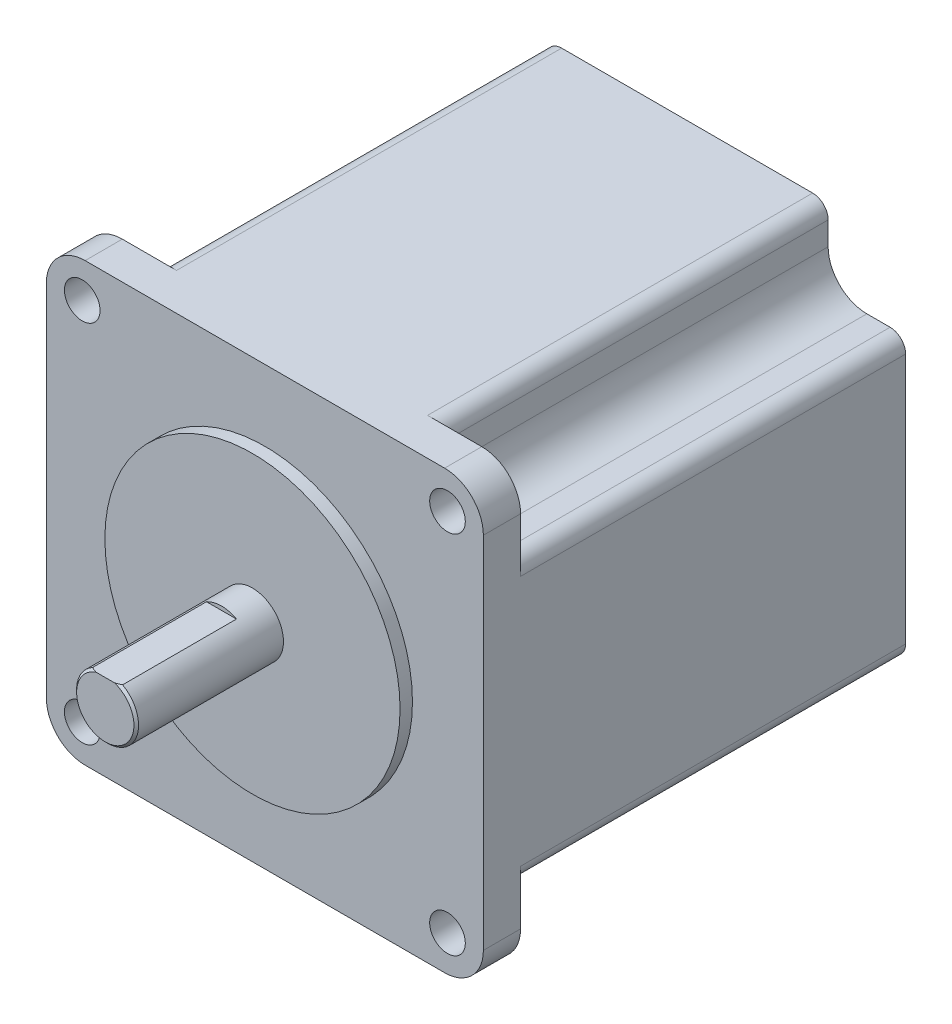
ISO-10303-21;
HEADER;
FILE_DESCRIPTION(('STEP AP214'),'2;1');
FILE_NAME('part.step','',(''),(''),'','','');
FILE_SCHEMA(('AUTOMOTIVE_DESIGN { 1 0 10303 214 1 1 1 1 }'));
ENDSEC;
DATA;
#1=APPLICATION_CONTEXT('core data for automotive mechanical design processes');
#2=APPLICATION_PROTOCOL_DEFINITION('international standard','automotive_design',2000,#1);
#3=PRODUCT_CONTEXT('',#1,'mechanical');
#4=PRODUCT('Part','Part','',(#3));
#5=PRODUCT_RELATED_PRODUCT_CATEGORY('part','',(#4));
#6=PRODUCT_DEFINITION_FORMATION('','',#4);
#7=PRODUCT_DEFINITION_CONTEXT('part definition',#1,'design');
#8=PRODUCT_DEFINITION('design','',#6,#7);
#9=PRODUCT_DEFINITION_SHAPE('','',#8);
#10=(LENGTH_UNIT() NAMED_UNIT(*) SI_UNIT(.MILLI.,.METRE.));
#11=(NAMED_UNIT(*) PLANE_ANGLE_UNIT() SI_UNIT($,.RADIAN.));
#12=(NAMED_UNIT(*) SI_UNIT($,.STERADIAN.) SOLID_ANGLE_UNIT());
#13=UNCERTAINTY_MEASURE_WITH_UNIT(LENGTH_MEASURE(1.E-05),#10,'distance_accuracy_value','');
#14=(GEOMETRIC_REPRESENTATION_CONTEXT(3) GLOBAL_UNCERTAINTY_ASSIGNED_CONTEXT((#13)) GLOBAL_UNIT_ASSIGNED_CONTEXT((#10,
#11,#12)) REPRESENTATION_CONTEXT('',''));
#15=CARTESIAN_POINT('',(0.,0.,0.));
#16=DIRECTION('',(0.,0.,1.));
#17=DIRECTION('',(1.,0.,0.));
#18=AXIS2_PLACEMENT_3D('',#15,#16,#17);
#19=CARTESIAN_POINT('',(23.2,-23.2,-56.1));
#20=DIRECTION('',(0.,0.,1.));
#21=DIRECTION('',(1.,0.,0.));
#22=AXIS2_PLACEMENT_3D('',#19,#20,#21);
#23=CYLINDRICAL_SURFACE('',#22,5.);
#24=CARTESIAN_POINT('',(23.2,-23.2,-6.4));
#25=DIRECTION('',(0.,0.,-1.));
#26=DIRECTION('',(-1.,0.,0.));
#27=AXIS2_PLACEMENT_3D('',#24,#25,#26);
#28=CIRCLE('',#27,5.);
#29=CARTESIAN_POINT('',(28.2,-23.2,-6.4));
#30=VERTEX_POINT('',#29);
#31=CARTESIAN_POINT('',(23.2,-28.2,-6.4));
#32=VERTEX_POINT('',#31);
#33=EDGE_CURVE('E308',#30,#32,#28,.T.);
#34=ORIENTED_EDGE('',*,*,#33,.F.);
#35=DIRECTION('',(0.,0.,1.));
#36=VECTOR('',#35,1.);
#37=CARTESIAN_POINT('',(28.2,-23.2,-56.1));
#38=LINE('',#37,#36);
#39=CARTESIAN_POINT('',(28.2,-23.2,-1.6));
#40=VERTEX_POINT('',#39);
#41=EDGE_CURVE('E473',#30,#40,#38,.T.);
#42=ORIENTED_EDGE('',*,*,#41,.T.);
#43=CARTESIAN_POINT('',(23.2,-23.2,-1.6));
#44=DIRECTION('',(0.,0.,-1.));
#45=DIRECTION('',(1.,0.,0.));
#46=AXIS2_PLACEMENT_3D('',#43,#44,#45);
#47=CIRCLE('',#46,5.);
#48=CARTESIAN_POINT('',(23.2,-28.2,-1.6));
#49=VERTEX_POINT('',#48);
#50=EDGE_CURVE('E463',#40,#49,#47,.T.);
#51=ORIENTED_EDGE('',*,*,#50,.T.);
#52=DIRECTION('',(0.,0.,1.));
#53=VECTOR('',#52,1.);
#54=CARTESIAN_POINT('',(23.2,-28.2,-56.1));
#55=LINE('',#54,#53);
#56=EDGE_CURVE('E509',#32,#49,#55,.T.);
#57=ORIENTED_EDGE('',*,*,#56,.F.);
#58=EDGE_LOOP('',(#34,#42,#51,#57));
#59=FACE_BOUND('',#58,.T.);
#60=ADVANCED_FACE('F33',(#59),#23,.T.);
#61=CARTESIAN_POINT('',(-23.2,-23.2,-56.1));
#62=DIRECTION('',(0.,0.,1.));
#63=DIRECTION('',(1.,0.,0.));
#64=AXIS2_PLACEMENT_3D('',#61,#62,#63);
#65=CYLINDRICAL_SURFACE('',#64,5.);
#66=CARTESIAN_POINT('',(-23.2,-23.2,-6.4));
#67=DIRECTION('',(0.,0.,-1.));
#68=DIRECTION('',(-1.,0.,0.));
#69=AXIS2_PLACEMENT_3D('',#66,#67,#68);
#70=CIRCLE('',#69,5.);
#71=CARTESIAN_POINT('',(-23.2,-28.2,-6.4));
#72=VERTEX_POINT('',#71);
#73=CARTESIAN_POINT('',(-28.2,-23.2,-6.4));
#74=VERTEX_POINT('',#73);
#75=EDGE_CURVE('E353',#72,#74,#70,.T.);
#76=ORIENTED_EDGE('',*,*,#75,.F.);
#77=DIRECTION('',(0.,0.,1.));
#78=VECTOR('',#77,1.);
#79=CARTESIAN_POINT('',(-23.2,-28.2,-56.1));
#80=LINE('',#79,#78);
#81=CARTESIAN_POINT('',(-23.2,-28.2,-1.6));
#82=VERTEX_POINT('',#81);
#83=EDGE_CURVE('E507',#72,#82,#80,.T.);
#84=ORIENTED_EDGE('',*,*,#83,.T.);
#85=CARTESIAN_POINT('',(-23.2,-23.2,-1.6));
#86=DIRECTION('',(0.,0.,-1.));
#87=DIRECTION('',(1.,0.,0.));
#88=AXIS2_PLACEMENT_3D('',#85,#86,#87);
#89=CIRCLE('',#88,5.);
#90=CARTESIAN_POINT('',(-28.2,-23.2,-1.6));
#91=VERTEX_POINT('',#90);
#92=EDGE_CURVE('E479',#82,#91,#89,.T.);
#93=ORIENTED_EDGE('',*,*,#92,.T.);
#94=DIRECTION('',(0.,0.,1.));
#95=VECTOR('',#94,1.);
#96=CARTESIAN_POINT('',(-28.2,-23.2,-56.1));
#97=LINE('',#96,#95);
#98=EDGE_CURVE('E505',#74,#91,#97,.T.);
#99=ORIENTED_EDGE('',*,*,#98,.F.);
#100=EDGE_LOOP('',(#76,#84,#93,#99));
#101=FACE_BOUND('',#100,.T.);
#102=ADVANCED_FACE('F592',(#101),#65,.T.);
#103=CARTESIAN_POINT('',(23.2,23.2,-56.1));
#104=DIRECTION('',(0.,0.,1.));
#105=DIRECTION('',(1.,0.,0.));
#106=AXIS2_PLACEMENT_3D('',#103,#104,#105);
#107=CYLINDRICAL_SURFACE('',#106,5.);
#108=CARTESIAN_POINT('',(23.2,23.2,-6.4));
#109=DIRECTION('',(0.,0.,-1.));
#110=DIRECTION('',(-1.,0.,0.));
#111=AXIS2_PLACEMENT_3D('',#108,#109,#110);
#112=CIRCLE('',#111,5.);
#113=CARTESIAN_POINT('',(23.2,28.2,-6.4));
#114=VERTEX_POINT('',#113);
#115=CARTESIAN_POINT('',(28.2,23.2,-6.4));
#116=VERTEX_POINT('',#115);
#117=EDGE_CURVE('E400',#114,#116,#112,.T.);
#118=ORIENTED_EDGE('',*,*,#117,.F.);
#119=DIRECTION('',(0.,0.,1.));
#120=VECTOR('',#119,1.);
#121=CARTESIAN_POINT('',(23.2,28.2,-56.1));
#122=LINE('',#121,#120);
#123=CARTESIAN_POINT('',(23.2,28.2,-1.6));
#124=VERTEX_POINT('',#123);
#125=EDGE_CURVE('E499',#114,#124,#122,.T.);
#126=ORIENTED_EDGE('',*,*,#125,.T.);
#127=CARTESIAN_POINT('',(23.2,23.2,-1.6));
#128=DIRECTION('',(0.,0.,-1.));
#129=DIRECTION('',(1.,0.,0.));
#130=AXIS2_PLACEMENT_3D('',#127,#128,#129);
#131=CIRCLE('',#130,5.);
#132=CARTESIAN_POINT('',(28.2,23.2,-1.6));
#133=VERTEX_POINT('',#132);
#134=EDGE_CURVE('E491',#124,#133,#131,.T.);
#135=ORIENTED_EDGE('',*,*,#134,.T.);
#136=DIRECTION('',(0.,0.,1.));
#137=VECTOR('',#136,1.);
#138=CARTESIAN_POINT('',(28.2,23.2,-56.1));
#139=LINE('',#138,#137);
#140=EDGE_CURVE('E497',#116,#133,#139,.T.);
#141=ORIENTED_EDGE('',*,*,#140,.F.);
#142=EDGE_LOOP('',(#118,#126,#135,#141));
#143=FACE_BOUND('',#142,.T.);
#144=ADVANCED_FACE('F583',(#143),#107,.T.);
#145=CARTESIAN_POINT('',(0.,0.,0.));
#146=DIRECTION('',(0.,0.,1.));
#147=DIRECTION('',(1.,0.,0.));
#148=AXIS2_PLACEMENT_3D('',#145,#146,#147);
#149=PLANE('',#148);
#150=CARTESIAN_POINT('',(0.,0.,0.));
#151=DIRECTION('',(0.,0.,1.));
#152=DIRECTION('',(1.,0.,0.));
#153=AXIS2_PLACEMENT_3D('',#150,#151,#152);
#154=CIRCLE('',#153,19.05);
#155=CARTESIAN_POINT('',(19.05,0.,0.));
#156=VERTEX_POINT('',#155);
#157=EDGE_CURVE('E528',#156,#156,#154,.T.);
#158=ORIENTED_EDGE('',*,*,#157,.T.);
#159=EDGE_LOOP('',(#158));
#160=FACE_BOUND('',#159,.T.);
#161=CARTESIAN_POINT('',(0.,0.,0.));
#162=DIRECTION('',(0.,0.,1.));
#163=DIRECTION('',(1.,0.,0.));
#164=AXIS2_PLACEMENT_3D('',#161,#162,#163);
#165=CIRCLE('',#164,4.);
#166=CARTESIAN_POINT('',(4.,0.,0.));
#167=VERTEX_POINT('',#166);
#168=EDGE_CURVE('E524',#167,#167,#165,.T.);
#169=ORIENTED_EDGE('',*,*,#168,.F.);
#170=EDGE_LOOP('',(#169));
#171=FACE_BOUND('',#170,.T.);
#172=ADVANCED_FACE('F581',(#160,#171),#149,.T.);
#173=CARTESIAN_POINT('',(0.,0.,-1.6));
#174=DIRECTION('',(0.,0.,1.));
#175=DIRECTION('',(1.,0.,0.));
#176=AXIS2_PLACEMENT_3D('',#173,#174,#175);
#177=CYLINDRICAL_SURFACE('',#176,19.05);
#178=CARTESIAN_POINT('',(0.,0.,-1.6));
#179=DIRECTION('',(0.,0.,1.));
#180=DIRECTION('',(1.,0.,0.));
#181=AXIS2_PLACEMENT_3D('',#178,#179,#180);
#182=CIRCLE('',#181,19.05);
#183=CARTESIAN_POINT('',(19.05,0.,-1.6));
#184=VERTEX_POINT('',#183);
#185=EDGE_CURVE('E511',#184,#184,#182,.F.);
#186=ORIENTED_EDGE('',*,*,#185,.F.);
#187=EDGE_LOOP('',(#186));
#188=FACE_BOUND('',#187,.T.);
#189=ORIENTED_EDGE('',*,*,#157,.F.);
#190=EDGE_LOOP('',(#189));
#191=FACE_BOUND('',#190,.T.);
#192=ADVANCED_FACE('F580',(#188,#191),#177,.T.);
#193=CARTESIAN_POINT('',(0.,0.,19.));
#194=DIRECTION('',(0.,0.,-1.));
#195=DIRECTION('',(-1.,0.,0.));
#196=AXIS2_PLACEMENT_3D('',#193,#194,#195);
#197=CYLINDRICAL_SURFACE('',#196,4.);
#198=DIRECTION('',(0.,0.,1.));
#199=VECTOR('',#198,1.);
#200=CARTESIAN_POINT('',(1.93649167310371,3.5,4.));
#201=LINE('',#200,#199);
#202=CARTESIAN_POINT('',(1.93649167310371,3.5,4.));
#203=VERTEX_POINT('',#202);
#204=CARTESIAN_POINT('',(1.93649167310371,3.5,18.7));
#205=VERTEX_POINT('',#204);
#206=EDGE_CURVE('E522',#203,#205,#201,.T.);
#207=ORIENTED_EDGE('',*,*,#206,.T.);
#208=CARTESIAN_POINT('',(0.,0.,18.7));
#209=DIRECTION('',(0.,0.,1.));
#210=DIRECTION('',(1.,0.,0.));
#211=AXIS2_PLACEMENT_3D('',#208,#209,#210);
#212=CIRCLE('',#211,4.);
#213=CARTESIAN_POINT('',(-1.93649167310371,3.5,18.7));
#214=VERTEX_POINT('',#213);
#215=EDGE_CURVE('E11',#205,#214,#212,.F.);
#216=ORIENTED_EDGE('',*,*,#215,.T.);
#217=DIRECTION('',(0.,0.,1.));
#218=VECTOR('',#217,1.);
#219=CARTESIAN_POINT('',(-1.93649167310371,3.5,4.));
#220=LINE('',#219,#218);
#221=CARTESIAN_POINT('',(-1.93649167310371,3.5,4.));
#222=VERTEX_POINT('',#221);
#223=EDGE_CURVE('E520',#222,#214,#220,.T.);
#224=ORIENTED_EDGE('',*,*,#223,.F.);
#225=CARTESIAN_POINT('',(0.,0.,4.));
#226=DIRECTION('',(0.,0.,1.));
#227=DIRECTION('',(1.,0.,0.));
#228=AXIS2_PLACEMENT_3D('',#225,#226,#227);
#229=CIRCLE('',#228,4.);
#230=EDGE_CURVE('E515',#203,#222,#229,.T.);
#231=ORIENTED_EDGE('',*,*,#230,.F.);
#232=EDGE_LOOP('',(#207,#216,#224,#231));
#233=FACE_BOUND('',#232,.T.);
#234=ORIENTED_EDGE('',*,*,#168,.T.);
#235=EDGE_LOOP('',(#234));
#236=FACE_BOUND('',#235,.T.);
#237=ADVANCED_FACE('F576',(#233,#236),#197,.T.);
#238=CARTESIAN_POINT('',(0.,0.,19.));
#239=DIRECTION('',(0.,0.,1.));
#240=DIRECTION('',(1.,0.,0.));
#241=AXIS2_PLACEMENT_3D('',#238,#239,#240);
#242=PLANE('',#241);
#243=DIRECTION('',(1.,0.,0.));
#244=VECTOR('',#243,1.);
#245=CARTESIAN_POINT('',(-1.93649167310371,3.5,19.));
#246=LINE('',#245,#244);
#247=CARTESIAN_POINT('',(-1.19999999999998,3.5,19.));
#248=VERTEX_POINT('',#247);
#249=CARTESIAN_POINT('',(1.19999999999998,3.5,19.));
#250=VERTEX_POINT('',#249);
#251=EDGE_CURVE('E514',#248,#250,#246,.T.);
#252=ORIENTED_EDGE('',*,*,#251,.F.);
#253=CARTESIAN_POINT('',(0.,0.,19.));
#254=DIRECTION('',(0.,0.,1.));
#255=DIRECTION('',(1.,0.,0.));
#256=AXIS2_PLACEMENT_3D('',#253,#254,#255);
#257=CIRCLE('',#256,3.69999999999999);
#258=EDGE_CURVE('E540',#248,#250,#257,.T.);
#259=ORIENTED_EDGE('',*,*,#258,.T.);
#260=EDGE_LOOP('',(#252,#259));
#261=FACE_BOUND('',#260,.T.);
#262=ADVANCED_FACE('F571',(#261),#242,.T.);
#263=CARTESIAN_POINT('',(-1.93649167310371,3.5,4.));
#264=DIRECTION('',(0.,-1.,0.));
#265=DIRECTION('',(0.,0.,-1.));
#266=AXIS2_PLACEMENT_3D('',#263,#264,#265);
#267=PLANE('',#266);
#268=ORIENTED_EDGE('',*,*,#251,.T.);
#269=CARTESIAN_POINT('',(1.19999999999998,3.5,19.));
#270=CARTESIAN_POINT('',(1.26313496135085,3.5,18.979522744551));
#271=CARTESIAN_POINT('',(1.32583684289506,3.5,18.9577420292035));
#272=CARTESIAN_POINT('',(1.45030237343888,3.5,18.9118563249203));
#273=CARTESIAN_POINT('',(1.51206703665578,3.5,18.8877540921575));
#274=CARTESIAN_POINT('',(1.63472492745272,3.5,18.8374625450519));
#275=CARTESIAN_POINT('',(1.69561828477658,3.5,18.8112735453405));
#276=CARTESIAN_POINT('',(1.8166407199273,3.5,18.7569984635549));
#277=CARTESIAN_POINT('',(1.87676881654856,3.5,18.7289101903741));
#278=CARTESIAN_POINT('',(1.93649167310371,3.5,18.7));
#279=B_SPLINE_CURVE_WITH_KNOTS('',3,(#269,#270,#271,#272,#273,#274,#275,#276,#277,#278),
.UNSPECIFIED.,.F.,.F.,(4,2,2,2,4),(0.,0.199089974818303,0.397946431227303,0.596772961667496,
0.795832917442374),.UNSPECIFIED.);
#280=EDGE_CURVE('E42',#250,#205,#279,.T.);
#281=ORIENTED_EDGE('',*,*,#280,.T.);
#282=ORIENTED_EDGE('',*,*,#206,.F.);
#283=DIRECTION('',(1.,0.,0.));
#284=VECTOR('',#283,1.);
#285=CARTESIAN_POINT('',(-1.93649167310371,3.5,4.));
#286=LINE('',#285,#284);
#287=EDGE_CURVE('E517',#222,#203,#286,.T.);
#288=ORIENTED_EDGE('',*,*,#287,.F.);
#289=ORIENTED_EDGE('',*,*,#223,.T.);
#290=CARTESIAN_POINT('',(-1.93649167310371,3.5,18.7));
#291=CARTESIAN_POINT('',(-1.87676881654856,3.5,18.7289101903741));
#292=CARTESIAN_POINT('',(-1.8166407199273,3.5,18.7569984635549));
#293=CARTESIAN_POINT('',(-1.69561828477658,3.5,18.8112735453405));
#294=CARTESIAN_POINT('',(-1.63472492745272,3.5,18.8374625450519));
#295=CARTESIAN_POINT('',(-1.51206703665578,3.5,18.8877540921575));
#296=CARTESIAN_POINT('',(-1.45030237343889,3.5,18.9118563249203));
#297=CARTESIAN_POINT('',(-1.32583684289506,3.5,18.9577420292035));
#298=CARTESIAN_POINT('',(-1.26313496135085,3.5,18.979522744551));
#299=CARTESIAN_POINT('',(-1.19999999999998,3.5,19.));
#300=B_SPLINE_CURVE_WITH_KNOTS('',3,(#290,#291,#292,#293,#294,#295,#296,#297,#298,#299),
.UNSPECIFIED.,.F.,.F.,(4,2,2,2,4),(0.,0.199059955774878,0.397886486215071,0.596742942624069,
0.795832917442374),.UNSPECIFIED.);
#301=EDGE_CURVE('E557',#214,#248,#300,.T.);
#302=ORIENTED_EDGE('',*,*,#301,.T.);
#303=EDGE_LOOP('',(#268,#281,#282,#288,#289,#302));
#304=FACE_BOUND('',#303,.T.);
#305=ADVANCED_FACE('F565',(#304),#267,.F.);
#306=CARTESIAN_POINT('',(0.,0.,4.));
#307=DIRECTION('',(0.,0.,1.));
#308=DIRECTION('',(1.,0.,0.));
#309=AXIS2_PLACEMENT_3D('',#306,#307,#308);
#310=PLANE('',#309);
#311=ORIENTED_EDGE('',*,*,#230,.T.);
#312=ORIENTED_EDGE('',*,*,#287,.T.);
#313=EDGE_LOOP('',(#311,#312));
#314=FACE_BOUND('',#313,.T.);
#315=ADVANCED_FACE('F570',(#314),#310,.T.);
#316=CARTESIAN_POINT('',(-23.2,-28.2,-56.1));
#317=DIRECTION('',(0.,1.,0.));
#318=DIRECTION('',(-1.,0.,0.));
#319=AXIS2_PLACEMENT_3D('',#316,#317,#318);
#320=PLANE('',#319);
#321=DIRECTION('',(0.,0.,-1.));
#322=VECTOR('',#321,1.);
#323=CARTESIAN_POINT('',(-16.2,-28.2,-6.4));
#324=LINE('',#323,#322);
#325=CARTESIAN_POINT('',(-16.2,-28.2,-6.4));
#326=VERTEX_POINT('',#325);
#327=CARTESIAN_POINT('',(-16.2,-28.2,-56.1));
#328=VERTEX_POINT('',#327);
#329=EDGE_CURVE('E337',#326,#328,#324,.T.);
#330=ORIENTED_EDGE('',*,*,#329,.T.);
#331=DIRECTION('',(-1.,0.,0.));
#332=VECTOR('',#331,1.);
#333=CARTESIAN_POINT('',(-23.2,-28.2,-56.1));
#334=LINE('',#333,#332);
#335=CARTESIAN_POINT('',(16.2,-28.2,-56.1));
#336=VERTEX_POINT('',#335);
#337=EDGE_CURVE('E464',#336,#328,#334,.T.);
#338=ORIENTED_EDGE('',*,*,#337,.F.);
#339=DIRECTION('',(0.,0.,-1.));
#340=VECTOR('',#339,1.);
#341=CARTESIAN_POINT('',(16.2,-28.2,-6.4));
#342=LINE('',#341,#340);
#343=CARTESIAN_POINT('',(16.2,-28.2,-6.4));
#344=VERTEX_POINT('',#343);
#345=EDGE_CURVE('E311',#344,#336,#342,.T.);
#346=ORIENTED_EDGE('',*,*,#345,.F.);
#347=DIRECTION('',(-1.,0.,0.));
#348=VECTOR('',#347,1.);
#349=CARTESIAN_POINT('',(-23.2,-28.2,-6.4));
#350=LINE('',#349,#348);
#351=EDGE_CURVE('E318',#32,#344,#350,.T.);
#352=ORIENTED_EDGE('',*,*,#351,.F.);
#353=ORIENTED_EDGE('',*,*,#56,.T.);
#354=DIRECTION('',(-1.,0.,0.));
#355=VECTOR('',#354,1.);
#356=CARTESIAN_POINT('',(-23.2,-28.2,-1.6));
#357=LINE('',#356,#355);
#358=EDGE_CURVE('E476',#49,#82,#357,.T.);
#359=ORIENTED_EDGE('',*,*,#358,.T.);
#360=ORIENTED_EDGE('',*,*,#83,.F.);
#361=DIRECTION('',(-1.,0.,0.));
#362=VECTOR('',#361,1.);
#363=CARTESIAN_POINT('',(-23.2,-28.2,-6.4));
#364=LINE('',#363,#362);
#365=EDGE_CURVE('E365',#326,#72,#364,.T.);
#366=ORIENTED_EDGE('',*,*,#365,.F.);
#367=EDGE_LOOP('',(#330,#338,#346,#352,#353,#359,#360,#366));
#368=FACE_BOUND('',#367,.T.);
#369=ADVANCED_FACE('F601',(#368),#320,.F.);
#370=CARTESIAN_POINT('',(-28.2,23.2,-56.1));
#371=DIRECTION('',(1.,0.,0.));
#372=DIRECTION('',(0.,1.,0.));
#373=AXIS2_PLACEMENT_3D('',#370,#371,#372);
#374=PLANE('',#373);
#375=DIRECTION('',(0.,0.,-1.));
#376=VECTOR('',#375,1.);
#377=CARTESIAN_POINT('',(-28.2,16.2,-6.4));
#378=LINE('',#377,#376);
#379=CARTESIAN_POINT('',(-28.2,16.2,-6.4));
#380=VERTEX_POINT('',#379);
#381=CARTESIAN_POINT('',(-28.2,16.2,-56.1));
#382=VERTEX_POINT('',#381);
#383=EDGE_CURVE('E445',#380,#382,#378,.T.);
#384=ORIENTED_EDGE('',*,*,#383,.T.);
#385=DIRECTION('',(0.,1.,0.));
#386=VECTOR('',#385,1.);
#387=CARTESIAN_POINT('',(-28.2,23.2,-56.1));
#388=LINE('',#387,#386);
#389=CARTESIAN_POINT('',(-28.2,-16.2,-56.1));
#390=VERTEX_POINT('',#389);
#391=EDGE_CURVE('E466',#390,#382,#388,.T.);
#392=ORIENTED_EDGE('',*,*,#391,.F.);
#393=DIRECTION('',(0.,0.,-1.));
#394=VECTOR('',#393,1.);
#395=CARTESIAN_POINT('',(-28.2,-16.2,-6.4));
#396=LINE('',#395,#394);
#397=CARTESIAN_POINT('',(-28.2,-16.2,-6.4));
#398=VERTEX_POINT('',#397);
#399=EDGE_CURVE('E360',#398,#390,#396,.T.);
#400=ORIENTED_EDGE('',*,*,#399,.F.);
#401=DIRECTION('',(0.,1.,0.));
#402=VECTOR('',#401,1.);
#403=CARTESIAN_POINT('',(-28.2,23.2,-6.4));
#404=LINE('',#403,#402);
#405=EDGE_CURVE('E536',#74,#398,#404,.T.);
#406=ORIENTED_EDGE('',*,*,#405,.F.);
#407=ORIENTED_EDGE('',*,*,#98,.T.);
#408=DIRECTION('',(0.,1.,0.));
#409=VECTOR('',#408,1.);
#410=CARTESIAN_POINT('',(-28.2,23.2,-1.6));
#411=LINE('',#410,#409);
#412=CARTESIAN_POINT('',(-28.2,23.2,-1.6));
#413=VERTEX_POINT('',#412);
#414=EDGE_CURVE('E482',#91,#413,#411,.T.);
#415=ORIENTED_EDGE('',*,*,#414,.T.);
#416=DIRECTION('',(0.,0.,1.));
#417=VECTOR('',#416,1.);
#418=CARTESIAN_POINT('',(-28.2,23.2,-56.1));
#419=LINE('',#418,#417);
#420=CARTESIAN_POINT('',(-28.2,23.2,-6.4));
#421=VERTEX_POINT('',#420);
#422=EDGE_CURVE('E503',#421,#413,#419,.T.);
#423=ORIENTED_EDGE('',*,*,#422,.F.);
#424=DIRECTION('',(0.,-1.,0.));
#425=VECTOR('',#424,1.);
#426=CARTESIAN_POINT('',(-28.2,23.2,-6.4));
#427=LINE('',#426,#425);
#428=EDGE_CURVE('E460',#421,#380,#427,.T.);
#429=ORIENTED_EDGE('',*,*,#428,.T.);
#430=EDGE_LOOP('',(#384,#392,#400,#406,#407,#415,#423,#429));
#431=FACE_BOUND('',#430,.T.);
#432=ADVANCED_FACE('F603',(#431),#374,.F.);
#433=CARTESIAN_POINT('',(-23.2,23.2,-56.1));
#434=DIRECTION('',(0.,0.,1.));
#435=DIRECTION('',(1.,0.,0.));
#436=AXIS2_PLACEMENT_3D('',#433,#434,#435);
#437=CYLINDRICAL_SURFACE('',#436,5.);
#438=DIRECTION('',(0.,0.,1.));
#439=VECTOR('',#438,1.);
#440=CARTESIAN_POINT('',(-23.2,28.2,-56.1));
#441=LINE('',#440,#439);
#442=CARTESIAN_POINT('',(-23.2,28.2,-6.4));
#443=VERTEX_POINT('',#442);
#444=CARTESIAN_POINT('',(-23.2,28.2,-1.6));
#445=VERTEX_POINT('',#444);
#446=EDGE_CURVE('E501',#443,#445,#441,.T.);
#447=ORIENTED_EDGE('',*,*,#446,.F.);
#448=CARTESIAN_POINT('',(-23.2,23.2,-6.4));
#449=DIRECTION('',(0.,0.,1.));
#450=DIRECTION('',(1.,0.,0.));
#451=AXIS2_PLACEMENT_3D('',#448,#449,#450);
#452=CIRCLE('',#451,5.);
#453=EDGE_CURVE('E448',#443,#421,#452,.T.);
#454=ORIENTED_EDGE('',*,*,#453,.T.);
#455=ORIENTED_EDGE('',*,*,#422,.T.);
#456=CARTESIAN_POINT('',(-23.2,23.2,-1.6));
#457=DIRECTION('',(0.,0.,-1.));
#458=DIRECTION('',(1.,0.,0.));
#459=AXIS2_PLACEMENT_3D('',#456,#457,#458);
#460=CIRCLE('',#459,5.);
#461=EDGE_CURVE('E485',#413,#445,#460,.T.);
#462=ORIENTED_EDGE('',*,*,#461,.T.);
#463=EDGE_LOOP('',(#447,#454,#455,#462));
#464=FACE_BOUND('',#463,.T.);
#465=ADVANCED_FACE('F608',(#464),#437,.T.);
#466=CARTESIAN_POINT('',(23.2,28.2,-56.1));
#467=DIRECTION('',(0.,-1.,0.));
#468=DIRECTION('',(1.,0.,0.));
#469=AXIS2_PLACEMENT_3D('',#466,#467,#468);
#470=PLANE('',#469);
#471=DIRECTION('',(0.,0.,-1.));
#472=VECTOR('',#471,1.);
#473=CARTESIAN_POINT('',(16.2,28.2,-6.4));
#474=LINE('',#473,#472);
#475=CARTESIAN_POINT('',(16.2,28.2,-6.4));
#476=VERTEX_POINT('',#475);
#477=CARTESIAN_POINT('',(16.2,28.2,-56.1));
#478=VERTEX_POINT('',#477);
#479=EDGE_CURVE('E384',#476,#478,#474,.T.);
#480=ORIENTED_EDGE('',*,*,#479,.T.);
#481=DIRECTION('',(1.,0.,0.));
#482=VECTOR('',#481,1.);
#483=CARTESIAN_POINT('',(0.,28.2,-56.1));
#484=LINE('',#483,#482);
#485=CARTESIAN_POINT('',(-16.2,28.2,-56.1));
#486=VERTEX_POINT('',#485);
#487=EDGE_CURVE('E469',#486,#478,#484,.T.);
#488=ORIENTED_EDGE('',*,*,#487,.F.);
#489=DIRECTION('',(0.,0.,-1.));
#490=VECTOR('',#489,1.);
#491=CARTESIAN_POINT('',(-16.2,28.2,-6.4));
#492=LINE('',#491,#490);
#493=CARTESIAN_POINT('',(-16.2,28.2,-6.4));
#494=VERTEX_POINT('',#493);
#495=EDGE_CURVE('E431',#494,#486,#492,.T.);
#496=ORIENTED_EDGE('',*,*,#495,.F.);
#497=DIRECTION('',(-1.,0.,0.));
#498=VECTOR('',#497,1.);
#499=CARTESIAN_POINT('',(23.2,28.2,-6.4));
#500=LINE('',#499,#498);
#501=EDGE_CURVE('E531',#494,#443,#500,.T.);
#502=ORIENTED_EDGE('',*,*,#501,.T.);
#503=ORIENTED_EDGE('',*,*,#446,.T.);
#504=DIRECTION('',(1.,0.,0.));
#505=VECTOR('',#504,1.);
#506=CARTESIAN_POINT('',(23.2,28.2,-1.6));
#507=LINE('',#506,#505);
#508=EDGE_CURVE('E488',#445,#124,#507,.T.);
#509=ORIENTED_EDGE('',*,*,#508,.T.);
#510=ORIENTED_EDGE('',*,*,#125,.F.);
#511=DIRECTION('',(1.,0.,0.));
#512=VECTOR('',#511,1.);
#513=CARTESIAN_POINT('',(23.2,28.2,-6.4));
#514=LINE('',#513,#512);
#515=EDGE_CURVE('E412',#476,#114,#514,.T.);
#516=ORIENTED_EDGE('',*,*,#515,.F.);
#517=EDGE_LOOP('',(#480,#488,#496,#502,#503,#509,#510,#516));
#518=FACE_BOUND('',#517,.T.);
#519=ADVANCED_FACE('F612',(#518),#470,.F.);
#520=CARTESIAN_POINT('',(28.2,-23.2,-56.1));
#521=DIRECTION('',(-1.,0.,0.));
#522=DIRECTION('',(0.,0.,1.));
#523=AXIS2_PLACEMENT_3D('',#520,#521,#522);
#524=PLANE('',#523);
#525=DIRECTION('',(0.,0.,-1.));
#526=VECTOR('',#525,1.);
#527=CARTESIAN_POINT('',(28.2,-16.2,-6.4));
#528=LINE('',#527,#526);
#529=CARTESIAN_POINT('',(28.2,-16.2,-6.4));
#530=VERTEX_POINT('',#529);
#531=CARTESIAN_POINT('',(28.2,-16.2,-56.1));
#532=VERTEX_POINT('',#531);
#533=EDGE_CURVE('E313',#530,#532,#528,.T.);
#534=ORIENTED_EDGE('',*,*,#533,.T.);
#535=DIRECTION('',(0.,-1.,0.));
#536=VECTOR('',#535,1.);
#537=CARTESIAN_POINT('',(28.2,-23.2,-56.1));
#538=LINE('',#537,#536);
#539=CARTESIAN_POINT('',(28.2,16.2,-56.1));
#540=VERTEX_POINT('',#539);
#541=EDGE_CURVE('E471',#540,#532,#538,.T.);
#542=ORIENTED_EDGE('',*,*,#541,.F.);
#543=DIRECTION('',(0.,0.,-1.));
#544=VECTOR('',#543,1.);
#545=CARTESIAN_POINT('',(28.2,16.2,-6.4));
#546=LINE('',#545,#544);
#547=CARTESIAN_POINT('',(28.2,16.2,-6.4));
#548=VERTEX_POINT('',#547);
#549=EDGE_CURVE('E407',#548,#540,#546,.T.);
#550=ORIENTED_EDGE('',*,*,#549,.F.);
#551=DIRECTION('',(0.,-1.,0.));
#552=VECTOR('',#551,1.);
#553=CARTESIAN_POINT('',(28.2,-23.2,-6.4));
#554=LINE('',#553,#552);
#555=EDGE_CURVE('E534',#116,#548,#554,.T.);
#556=ORIENTED_EDGE('',*,*,#555,.F.);
#557=ORIENTED_EDGE('',*,*,#140,.T.);
#558=DIRECTION('',(0.,-1.,0.));
#559=VECTOR('',#558,1.);
#560=CARTESIAN_POINT('',(28.2,-23.2,-1.6));
#561=LINE('',#560,#559);
#562=EDGE_CURVE('E467',#133,#40,#561,.T.);
#563=ORIENTED_EDGE('',*,*,#562,.T.);
#564=ORIENTED_EDGE('',*,*,#41,.F.);
#565=DIRECTION('',(0.,-1.,0.));
#566=VECTOR('',#565,1.);
#567=CARTESIAN_POINT('',(28.2,-23.2,-6.4));
#568=LINE('',#567,#566);
#569=EDGE_CURVE('E538',#530,#30,#568,.T.);
#570=ORIENTED_EDGE('',*,*,#569,.F.);
#571=EDGE_LOOP('',(#534,#542,#550,#556,#557,#563,#564,#570));
#572=FACE_BOUND('',#571,.T.);
#573=ADVANCED_FACE('F616',(#572),#524,.F.);
#574=CARTESIAN_POINT('',(23.2,-23.2,-56.1));
#575=DIRECTION('',(0.,0.,1.));
#576=DIRECTION('',(1.,0.,0.));
#577=AXIS2_PLACEMENT_3D('',#574,#575,#576);
#578=PLANE('',#577);
#579=DIRECTION('',(0.,1.,0.));
#580=VECTOR('',#579,1.);
#581=CARTESIAN_POINT('',(18.2,-26.2,-56.1));
#582=LINE('',#581,#580);
#583=CARTESIAN_POINT('',(18.2,-26.2,-56.1));
#584=VERTEX_POINT('',#583);
#585=CARTESIAN_POINT('',(18.2,-23.2,-56.1));
#586=VERTEX_POINT('',#585);
#587=EDGE_CURVE('E284',#584,#586,#582,.T.);
#588=ORIENTED_EDGE('',*,*,#587,.F.);
#589=CARTESIAN_POINT('',(16.2,-26.2,-56.1));
#590=DIRECTION('',(0.,0.,1.));
#591=DIRECTION('',(1.,0.,0.));
#592=AXIS2_PLACEMENT_3D('',#589,#590,#591);
#593=CIRCLE('',#592,1.99999999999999);
#594=EDGE_CURVE('E287',#336,#584,#593,.T.);
#595=ORIENTED_EDGE('',*,*,#594,.F.);
#596=ORIENTED_EDGE('',*,*,#337,.T.);
#597=CARTESIAN_POINT('',(-16.2,-26.2,-56.1));
#598=DIRECTION('',(0.,0.,1.));
#599=DIRECTION('',(-1.,0.,0.));
#600=AXIS2_PLACEMENT_3D('',#597,#598,#599);
#601=CIRCLE('',#600,2.);
#602=CARTESIAN_POINT('',(-18.2,-26.2,-56.1));
#603=VERTEX_POINT('',#602);
#604=EDGE_CURVE('E320',#603,#328,#601,.T.);
#605=ORIENTED_EDGE('',*,*,#604,.F.);
#606=DIRECTION('',(0.,-1.,0.));
#607=VECTOR('',#606,1.);
#608=CARTESIAN_POINT('',(-18.2,-26.2,-56.1));
#609=LINE('',#608,#607);
#610=CARTESIAN_POINT('',(-18.2,-23.2,-56.1));
#611=VERTEX_POINT('',#610);
#612=EDGE_CURVE('E325',#611,#603,#609,.T.);
#613=ORIENTED_EDGE('',*,*,#612,.F.);
#614=CARTESIAN_POINT('',(-23.2,-23.2,-56.1));
#615=DIRECTION('',(0.,0.,-1.));
#616=DIRECTION('',(1.,0.,0.));
#617=AXIS2_PLACEMENT_3D('',#614,#615,#616);
#618=CIRCLE('',#617,5.);
#619=CARTESIAN_POINT('',(-23.2,-18.2,-56.1));
#620=VERTEX_POINT('',#619);
#621=EDGE_CURVE('E346',#620,#611,#618,.T.);
#622=ORIENTED_EDGE('',*,*,#621,.F.);
#623=DIRECTION('',(1.,0.,0.));
#624=VECTOR('',#623,1.);
#625=CARTESIAN_POINT('',(-23.2,-18.2,-56.1));
#626=LINE('',#625,#624);
#627=CARTESIAN_POINT('',(-26.2,-18.2,-56.1));
#628=VERTEX_POINT('',#627);
#629=EDGE_CURVE('E343',#628,#620,#626,.T.);
#630=ORIENTED_EDGE('',*,*,#629,.F.);
#631=CARTESIAN_POINT('',(-26.2,-16.2,-56.1));
#632=DIRECTION('',(0.,0.,1.));
#633=DIRECTION('',(-1.,0.,0.));
#634=AXIS2_PLACEMENT_3D('',#631,#632,#633);
#635=CIRCLE('',#634,2.);
#636=EDGE_CURVE('E340',#390,#628,#635,.T.);
#637=ORIENTED_EDGE('',*,*,#636,.F.);
#638=ORIENTED_EDGE('',*,*,#391,.T.);
#639=CARTESIAN_POINT('',(-26.2,16.2,-56.1));
#640=DIRECTION('',(0.,0.,1.));
#641=DIRECTION('',(1.,0.,0.));
#642=AXIS2_PLACEMENT_3D('',#639,#640,#641);
#643=CIRCLE('',#642,2.);
#644=CARTESIAN_POINT('',(-26.2,18.2,-56.1));
#645=VERTEX_POINT('',#644);
#646=EDGE_CURVE('E419',#645,#382,#643,.T.);
#647=ORIENTED_EDGE('',*,*,#646,.F.);
#648=DIRECTION('',(-1.,0.,0.));
#649=VECTOR('',#648,1.);
#650=CARTESIAN_POINT('',(-23.2,18.2,-56.1));
#651=LINE('',#650,#649);
#652=CARTESIAN_POINT('',(-23.2,18.2,-56.1));
#653=VERTEX_POINT('',#652);
#654=EDGE_CURVE('E440',#653,#645,#651,.T.);
#655=ORIENTED_EDGE('',*,*,#654,.F.);
#656=CARTESIAN_POINT('',(-23.2,23.2,-56.1));
#657=DIRECTION('',(0.,0.,-1.));
#658=DIRECTION('',(-1.,0.,0.));
#659=AXIS2_PLACEMENT_3D('',#656,#657,#658);
#660=CIRCLE('',#659,5.);
#661=CARTESIAN_POINT('',(-18.2,23.2,-56.1));
#662=VERTEX_POINT('',#661);
#663=EDGE_CURVE('E437',#662,#653,#660,.T.);
#664=ORIENTED_EDGE('',*,*,#663,.F.);
#665=DIRECTION('',(0.,-1.,0.));
#666=VECTOR('',#665,1.);
#667=CARTESIAN_POINT('',(-18.2,26.2,-56.1));
#668=LINE('',#667,#666);
#669=CARTESIAN_POINT('',(-18.2,26.2,-56.1));
#670=VERTEX_POINT('',#669);
#671=EDGE_CURVE('E434',#670,#662,#668,.T.);
#672=ORIENTED_EDGE('',*,*,#671,.F.);
#673=CARTESIAN_POINT('',(-16.2,26.2,-56.1));
#674=DIRECTION('',(0.,0.,1.));
#675=DIRECTION('',(1.,0.,0.));
#676=AXIS2_PLACEMENT_3D('',#673,#674,#675);
#677=CIRCLE('',#676,2.);
#678=EDGE_CURVE('E414',#486,#670,#677,.T.);
#679=ORIENTED_EDGE('',*,*,#678,.F.);
#680=ORIENTED_EDGE('',*,*,#487,.T.);
#681=CARTESIAN_POINT('',(16.2,26.2,-56.1));
#682=DIRECTION('',(0.,0.,1.));
#683=DIRECTION('',(-1.,0.,0.));
#684=AXIS2_PLACEMENT_3D('',#681,#682,#683);
#685=CIRCLE('',#684,1.99999999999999);
#686=CARTESIAN_POINT('',(18.2,26.2,-56.1));
#687=VERTEX_POINT('',#686);
#688=EDGE_CURVE('E367',#687,#478,#685,.T.);
#689=ORIENTED_EDGE('',*,*,#688,.F.);
#690=DIRECTION('',(0.,1.,0.));
#691=VECTOR('',#690,1.);
#692=CARTESIAN_POINT('',(18.2,26.2,-56.1));
#693=LINE('',#692,#691);
#694=CARTESIAN_POINT('',(18.2,23.2,-56.1));
#695=VERTEX_POINT('',#694);
#696=EDGE_CURVE('E372',#695,#687,#693,.T.);
#697=ORIENTED_EDGE('',*,*,#696,.F.);
#698=CARTESIAN_POINT('',(23.2,23.2,-56.1));
#699=DIRECTION('',(0.,0.,-1.));
#700=DIRECTION('',(1.,0.,0.));
#701=AXIS2_PLACEMENT_3D('',#698,#699,#700);
#702=CIRCLE('',#701,5.);
#703=CARTESIAN_POINT('',(23.2,18.2,-56.1));
#704=VERTEX_POINT('',#703);
#705=EDGE_CURVE('E393',#704,#695,#702,.T.);
#706=ORIENTED_EDGE('',*,*,#705,.F.);
#707=DIRECTION('',(-1.,0.,0.));
#708=VECTOR('',#707,1.);
#709=CARTESIAN_POINT('',(23.2,18.2,-56.1));
#710=LINE('',#709,#708);
#711=CARTESIAN_POINT('',(26.2,18.2,-56.1));
#712=VERTEX_POINT('',#711);
#713=EDGE_CURVE('E390',#712,#704,#710,.T.);
#714=ORIENTED_EDGE('',*,*,#713,.F.);
#715=CARTESIAN_POINT('',(26.2,16.2,-56.1));
#716=DIRECTION('',(0.,0.,1.));
#717=DIRECTION('',(-1.,0.,0.));
#718=AXIS2_PLACEMENT_3D('',#715,#716,#717);
#719=CIRCLE('',#718,2.);
#720=EDGE_CURVE('E387',#540,#712,#719,.T.);
#721=ORIENTED_EDGE('',*,*,#720,.F.);
#722=ORIENTED_EDGE('',*,*,#541,.T.);
#723=CARTESIAN_POINT('',(26.2,-16.2,-56.1));
#724=DIRECTION('',(0.,0.,1.));
#725=DIRECTION('',(1.,0.,0.));
#726=AXIS2_PLACEMENT_3D('',#723,#724,#725);
#727=CIRCLE('',#726,2.);
#728=CARTESIAN_POINT('',(26.2,-18.2,-56.1));
#729=VERTEX_POINT('',#728);
#730=EDGE_CURVE('E301',#729,#532,#727,.T.);
#731=ORIENTED_EDGE('',*,*,#730,.F.);
#732=DIRECTION('',(1.,0.,0.));
#733=VECTOR('',#732,1.);
#734=CARTESIAN_POINT('',(23.2,-18.2,-56.1));
#735=LINE('',#734,#733);
#736=CARTESIAN_POINT('',(23.2,-18.2,-56.1));
#737=VERTEX_POINT('',#736);
#738=EDGE_CURVE('E298',#737,#729,#735,.T.);
#739=ORIENTED_EDGE('',*,*,#738,.F.);
#740=CARTESIAN_POINT('',(23.2,-23.2,-56.1));
#741=DIRECTION('',(0.,0.,-1.));
#742=DIRECTION('',(-1.,0.,0.));
#743=AXIS2_PLACEMENT_3D('',#740,#741,#742);
#744=CIRCLE('',#743,5.);
#745=EDGE_CURVE('E266',#586,#737,#744,.T.);
#746=ORIENTED_EDGE('',*,*,#745,.F.);
#747=EDGE_LOOP('',(#588,#595,#596,#605,#613,#622,#630,#637,#638,#647,#655,#664,#672,#679,#680,
#689,#697,#706,#714,#721,#722,#731,#739,#746));
#748=FACE_BOUND('',#747,.T.);
#749=ADVANCED_FACE('F623',(#748),#578,.F.);
#750=CARTESIAN_POINT('',(23.2,-23.2,-1.6));
#751=DIRECTION('',(0.,0.,1.));
#752=DIRECTION('',(1.,0.,0.));
#753=AXIS2_PLACEMENT_3D('',#750,#751,#752);
#754=PLANE('',#753);
#755=CARTESIAN_POINT('',(-23.57,-23.57,-1.6));
#756=DIRECTION('',(0.,0.,1.));
#757=DIRECTION('',(1.,0.,0.));
#758=AXIS2_PLACEMENT_3D('',#755,#756,#757);
#759=CIRCLE('',#758,2.3);
#760=CARTESIAN_POINT('',(-21.27,-23.57,-1.6));
#761=VERTEX_POINT('',#760);
#762=EDGE_CURVE('E554',#761,#761,#759,.T.);
#763=ORIENTED_EDGE('',*,*,#762,.F.);
#764=EDGE_LOOP('',(#763));
#765=FACE_BOUND('',#764,.T.);
#766=CARTESIAN_POINT('',(23.57,-23.57,-1.6));
#767=DIRECTION('',(0.,0.,1.));
#768=DIRECTION('',(1.,0.,0.));
#769=AXIS2_PLACEMENT_3D('',#766,#767,#768);
#770=CIRCLE('',#769,2.3);
#771=CARTESIAN_POINT('',(25.87,-23.57,-1.6));
#772=VERTEX_POINT('',#771);
#773=EDGE_CURVE('E550',#772,#772,#770,.T.);
#774=ORIENTED_EDGE('',*,*,#773,.F.);
#775=EDGE_LOOP('',(#774));
#776=FACE_BOUND('',#775,.T.);
#777=CARTESIAN_POINT('',(23.57,23.57,-1.6));
#778=DIRECTION('',(0.,0.,1.));
#779=DIRECTION('',(1.,0.,0.));
#780=AXIS2_PLACEMENT_3D('',#777,#778,#779);
#781=CIRCLE('',#780,2.3);
#782=CARTESIAN_POINT('',(25.87,23.57,-1.6));
#783=VERTEX_POINT('',#782);
#784=EDGE_CURVE('E546',#783,#783,#781,.T.);
#785=ORIENTED_EDGE('',*,*,#784,.F.);
#786=EDGE_LOOP('',(#785));
#787=FACE_BOUND('',#786,.T.);
#788=CARTESIAN_POINT('',(-23.57,23.57,-1.6));
#789=DIRECTION('',(0.,0.,1.));
#790=DIRECTION('',(1.,0.,0.));
#791=AXIS2_PLACEMENT_3D('',#788,#789,#790);
#792=CIRCLE('',#791,2.3);
#793=CARTESIAN_POINT('',(-21.27,23.57,-1.6));
#794=VERTEX_POINT('',#793);
#795=EDGE_CURVE('E290',#794,#794,#792,.T.);
#796=ORIENTED_EDGE('',*,*,#795,.F.);
#797=EDGE_LOOP('',(#796));
#798=FACE_BOUND('',#797,.T.);
#799=ORIENTED_EDGE('',*,*,#185,.T.);
#800=EDGE_LOOP('',(#799));
#801=FACE_BOUND('',#800,.T.);
#802=ORIENTED_EDGE('',*,*,#50,.F.);
#803=ORIENTED_EDGE('',*,*,#562,.F.);
#804=ORIENTED_EDGE('',*,*,#134,.F.);
#805=ORIENTED_EDGE('',*,*,#508,.F.);
#806=ORIENTED_EDGE('',*,*,#461,.F.);
#807=ORIENTED_EDGE('',*,*,#414,.F.);
#808=ORIENTED_EDGE('',*,*,#92,.F.);
#809=ORIENTED_EDGE('',*,*,#358,.F.);
#810=EDGE_LOOP('',(#802,#803,#804,#805,#806,#807,#808,#809));
#811=FACE_BOUND('',#810,.T.);
#812=ADVANCED_FACE('F625',(#765,#776,#787,#798,#801,#811),#754,.T.);
#813=CARTESIAN_POINT('',(-16.2,26.2,-6.4));
#814=DIRECTION('',(0.,0.,1.));
#815=DIRECTION('',(1.,0.,0.));
#816=AXIS2_PLACEMENT_3D('',#813,#814,#815);
#817=PLANE('',#816);
#818=CARTESIAN_POINT('',(-23.57,23.57,-6.4));
#819=DIRECTION('',(0.,0.,1.));
#820=DIRECTION('',(1.,0.,0.));
#821=AXIS2_PLACEMENT_3D('',#818,#819,#820);
#822=CIRCLE('',#821,2.3);
#823=CARTESIAN_POINT('',(-21.27,23.57,-6.4));
#824=VERTEX_POINT('',#823);
#825=EDGE_CURVE('E299',#824,#824,#822,.T.);
#826=ORIENTED_EDGE('',*,*,#825,.T.);
#827=EDGE_LOOP('',(#826));
#828=FACE_BOUND('',#827,.T.);
#829=ORIENTED_EDGE('',*,*,#453,.F.);
#830=ORIENTED_EDGE('',*,*,#501,.F.);
#831=CARTESIAN_POINT('',(-16.2,26.2,-6.4));
#832=DIRECTION('',(0.,0.,1.));
#833=DIRECTION('',(1.,0.,0.));
#834=AXIS2_PLACEMENT_3D('',#831,#832,#833);
#835=CIRCLE('',#834,2.);
#836=CARTESIAN_POINT('',(-18.2,26.2,-6.4));
#837=VERTEX_POINT('',#836);
#838=EDGE_CURVE('E415',#494,#837,#835,.T.);
#839=ORIENTED_EDGE('',*,*,#838,.T.);
#840=DIRECTION('',(0.,-1.,0.));
#841=VECTOR('',#840,1.);
#842=CARTESIAN_POINT('',(-18.2,26.2,-6.4));
#843=LINE('',#842,#841);
#844=CARTESIAN_POINT('',(-18.2,23.2,-6.4));
#845=VERTEX_POINT('',#844);
#846=EDGE_CURVE('E418',#837,#845,#843,.T.);
#847=ORIENTED_EDGE('',*,*,#846,.T.);
#848=CARTESIAN_POINT('',(-23.2,23.2,-6.4));
#849=DIRECTION('',(0.,0.,-1.));
#850=DIRECTION('',(-1.,0.,0.));
#851=AXIS2_PLACEMENT_3D('',#848,#849,#850);
#852=CIRCLE('',#851,5.);
#853=CARTESIAN_POINT('',(-23.2,18.2,-6.4));
#854=VERTEX_POINT('',#853);
#855=EDGE_CURVE('E422',#845,#854,#852,.T.);
#856=ORIENTED_EDGE('',*,*,#855,.T.);
#857=DIRECTION('',(-1.,0.,0.));
#858=VECTOR('',#857,1.);
#859=CARTESIAN_POINT('',(-23.2,18.2,-6.4));
#860=LINE('',#859,#858);
#861=CARTESIAN_POINT('',(-26.2,18.2,-6.4));
#862=VERTEX_POINT('',#861);
#863=EDGE_CURVE('E425',#854,#862,#860,.T.);
#864=ORIENTED_EDGE('',*,*,#863,.T.);
#865=CARTESIAN_POINT('',(-26.2,16.2,-6.4));
#866=DIRECTION('',(0.,0.,1.));
#867=DIRECTION('',(1.,0.,0.));
#868=AXIS2_PLACEMENT_3D('',#865,#866,#867);
#869=CIRCLE('',#868,2.);
#870=EDGE_CURVE('E428',#862,#380,#869,.T.);
#871=ORIENTED_EDGE('',*,*,#870,.T.);
#872=ORIENTED_EDGE('',*,*,#428,.F.);
#873=EDGE_LOOP('',(#829,#830,#839,#847,#856,#864,#871,#872));
#874=FACE_BOUND('',#873,.T.);
#875=ADVANCED_FACE('F628',(#828,#874),#817,.F.);
#876=CARTESIAN_POINT('',(-26.2,16.2,-6.4));
#877=DIRECTION('',(0.,0.,-1.));
#878=DIRECTION('',(-1.,0.,0.));
#879=AXIS2_PLACEMENT_3D('',#876,#877,#878);
#880=CYLINDRICAL_SURFACE('',#879,2.);
#881=ORIENTED_EDGE('',*,*,#646,.T.);
#882=ORIENTED_EDGE('',*,*,#383,.F.);
#883=ORIENTED_EDGE('',*,*,#870,.F.);
#884=DIRECTION('',(0.,0.,-1.));
#885=VECTOR('',#884,1.);
#886=CARTESIAN_POINT('',(-26.2,18.2,-6.4));
#887=LINE('',#886,#885);
#888=EDGE_CURVE('E449',#862,#645,#887,.T.);
#889=ORIENTED_EDGE('',*,*,#888,.T.);
#890=EDGE_LOOP('',(#881,#882,#883,#889));
#891=FACE_BOUND('',#890,.T.);
#892=ADVANCED_FACE('F649',(#891),#880,.T.);
#893=CARTESIAN_POINT('',(-23.2,18.2,-6.4));
#894=DIRECTION('',(0.,-1.,0.));
#895=DIRECTION('',(0.,0.,-1.));
#896=AXIS2_PLACEMENT_3D('',#893,#894,#895);
#897=PLANE('',#896);
#898=ORIENTED_EDGE('',*,*,#654,.T.);
#899=ORIENTED_EDGE('',*,*,#888,.F.);
#900=ORIENTED_EDGE('',*,*,#863,.F.);
#901=DIRECTION('',(0.,0.,-1.));
#902=VECTOR('',#901,1.);
#903=CARTESIAN_POINT('',(-23.2,18.2,-6.4));
#904=LINE('',#903,#902);
#905=EDGE_CURVE('E451',#854,#653,#904,.T.);
#906=ORIENTED_EDGE('',*,*,#905,.T.);
#907=EDGE_LOOP('',(#898,#899,#900,#906));
#908=FACE_BOUND('',#907,.T.);
#909=ADVANCED_FACE('F645',(#908),#897,.F.);
#910=CARTESIAN_POINT('',(-23.2,23.2,-6.4));
#911=DIRECTION('',(0.,0.,-1.));
#912=DIRECTION('',(-1.,0.,0.));
#913=AXIS2_PLACEMENT_3D('',#910,#911,#912);
#914=CYLINDRICAL_SURFACE('',#913,5.);
#915=ORIENTED_EDGE('',*,*,#663,.T.);
#916=ORIENTED_EDGE('',*,*,#905,.F.);
#917=ORIENTED_EDGE('',*,*,#855,.F.);
#918=DIRECTION('',(0.,0.,-1.));
#919=VECTOR('',#918,1.);
#920=CARTESIAN_POINT('',(-18.2,23.2,-6.4));
#921=LINE('',#920,#919);
#922=EDGE_CURVE('E453',#845,#662,#921,.T.);
#923=ORIENTED_EDGE('',*,*,#922,.T.);
#924=EDGE_LOOP('',(#915,#916,#917,#923));
#925=FACE_BOUND('',#924,.T.);
#926=ADVANCED_FACE('F641',(#925),#914,.F.);
#927=CARTESIAN_POINT('',(-18.2,26.2,-6.4));
#928=DIRECTION('',(1.,0.,0.));
#929=DIRECTION('',(0.,0.,-1.));
#930=AXIS2_PLACEMENT_3D('',#927,#928,#929);
#931=PLANE('',#930);
#932=ORIENTED_EDGE('',*,*,#671,.T.);
#933=ORIENTED_EDGE('',*,*,#922,.F.);
#934=ORIENTED_EDGE('',*,*,#846,.F.);
#935=DIRECTION('',(0.,0.,-1.));
#936=VECTOR('',#935,1.);
#937=CARTESIAN_POINT('',(-18.2,26.2,-6.4));
#938=LINE('',#937,#936);
#939=EDGE_CURVE('E455',#837,#670,#938,.T.);
#940=ORIENTED_EDGE('',*,*,#939,.T.);
#941=EDGE_LOOP('',(#932,#933,#934,#940));
#942=FACE_BOUND('',#941,.T.);
#943=ADVANCED_FACE('F637',(#942),#931,.F.);
#944=CARTESIAN_POINT('',(-16.2,26.2,-6.4));
#945=DIRECTION('',(0.,0.,-1.));
#946=DIRECTION('',(-1.,0.,0.));
#947=AXIS2_PLACEMENT_3D('',#944,#945,#946);
#948=CYLINDRICAL_SURFACE('',#947,2.);
#949=ORIENTED_EDGE('',*,*,#678,.T.);
#950=ORIENTED_EDGE('',*,*,#939,.F.);
#951=ORIENTED_EDGE('',*,*,#838,.F.);
#952=ORIENTED_EDGE('',*,*,#495,.T.);
#953=EDGE_LOOP('',(#949,#950,#951,#952));
#954=FACE_BOUND('',#953,.T.);
#955=ADVANCED_FACE('F633',(#954),#948,.T.);
#956=CARTESIAN_POINT('',(16.2,26.2,-6.4));
#957=DIRECTION('',(0.,0.,-1.));
#958=DIRECTION('',(-1.,0.,0.));
#959=AXIS2_PLACEMENT_3D('',#956,#957,#958);
#960=PLANE('',#959);
#961=CARTESIAN_POINT('',(23.57,23.57,-6.4));
#962=DIRECTION('',(0.,0.,-1.));
#963=DIRECTION('',(-1.,0.,0.));
#964=AXIS2_PLACEMENT_3D('',#961,#962,#963);
#965=CIRCLE('',#964,2.3);
#966=CARTESIAN_POINT('',(21.27,23.57,-6.4));
#967=VERTEX_POINT('',#966);
#968=EDGE_CURVE('E543',#967,#967,#965,.T.);
#969=ORIENTED_EDGE('',*,*,#968,.F.);
#970=EDGE_LOOP('',(#969));
#971=FACE_BOUND('',#970,.T.);
#972=ORIENTED_EDGE('',*,*,#515,.T.);
#973=ORIENTED_EDGE('',*,*,#117,.T.);
#974=ORIENTED_EDGE('',*,*,#555,.T.);
#975=CARTESIAN_POINT('',(26.2,16.2,-6.4));
#976=DIRECTION('',(0.,0.,1.));
#977=DIRECTION('',(-1.,0.,0.));
#978=AXIS2_PLACEMENT_3D('',#975,#976,#977);
#979=CIRCLE('',#978,2.);
#980=CARTESIAN_POINT('',(26.2,18.2,-6.4));
#981=VERTEX_POINT('',#980);
#982=EDGE_CURVE('E371',#548,#981,#979,.T.);
#983=ORIENTED_EDGE('',*,*,#982,.T.);
#984=DIRECTION('',(-1.,0.,0.));
#985=VECTOR('',#984,1.);
#986=CARTESIAN_POINT('',(23.2,18.2,-6.4));
#987=LINE('',#986,#985);
#988=CARTESIAN_POINT('',(23.2,18.2,-6.4));
#989=VERTEX_POINT('',#988);
#990=EDGE_CURVE('E375',#981,#989,#987,.T.);
#991=ORIENTED_EDGE('',*,*,#990,.T.);
#992=CARTESIAN_POINT('',(23.2,23.2,-6.4));
#993=DIRECTION('',(0.,0.,-1.));
#994=DIRECTION('',(1.,0.,0.));
#995=AXIS2_PLACEMENT_3D('',#992,#993,#994);
#996=CIRCLE('',#995,5.);
#997=CARTESIAN_POINT('',(18.2,23.2,-6.4));
#998=VERTEX_POINT('',#997);
#999=EDGE_CURVE('E378',#989,#998,#996,.T.);
#1000=ORIENTED_EDGE('',*,*,#999,.T.);
#1001=DIRECTION('',(0.,1.,0.));
#1002=VECTOR('',#1001,1.);
#1003=CARTESIAN_POINT('',(18.2,26.2,-6.4));
#1004=LINE('',#1003,#1002);
#1005=CARTESIAN_POINT('',(18.2,26.2,-6.4));
#1006=VERTEX_POINT('',#1005);
#1007=EDGE_CURVE('E381',#998,#1006,#1004,.T.);
#1008=ORIENTED_EDGE('',*,*,#1007,.T.);
#1009=CARTESIAN_POINT('',(16.2,26.2,-6.4));
#1010=DIRECTION('',(0.,0.,1.));
#1011=DIRECTION('',(-1.,0.,0.));
#1012=AXIS2_PLACEMENT_3D('',#1009,#1010,#1011);
#1013=CIRCLE('',#1012,1.99999999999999);
#1014=EDGE_CURVE('E368',#1006,#476,#1013,.T.);
#1015=ORIENTED_EDGE('',*,*,#1014,.T.);
#1016=EDGE_LOOP('',(#972,#973,#974,#983,#991,#1000,#1008,#1015));
#1017=FACE_BOUND('',#1016,.T.);
#1018=ADVANCED_FACE('F636',(#971,#1017),#960,.T.);
#1019=CARTESIAN_POINT('',(16.2,26.2,-6.4));
#1020=DIRECTION('',(0.,0.,-1.));
#1021=DIRECTION('',(-1.,0.,0.));
#1022=AXIS2_PLACEMENT_3D('',#1019,#1020,#1021);
#1023=CYLINDRICAL_SURFACE('',#1022,1.99999999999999);
#1024=ORIENTED_EDGE('',*,*,#688,.T.);
#1025=ORIENTED_EDGE('',*,*,#479,.F.);
#1026=ORIENTED_EDGE('',*,*,#1014,.F.);
#1027=DIRECTION('',(0.,0.,-1.));
#1028=VECTOR('',#1027,1.);
#1029=CARTESIAN_POINT('',(18.2,26.2,-6.4));
#1030=LINE('',#1029,#1028);
#1031=EDGE_CURVE('E398',#1006,#687,#1030,.T.);
#1032=ORIENTED_EDGE('',*,*,#1031,.T.);
#1033=EDGE_LOOP('',(#1024,#1025,#1026,#1032));
#1034=FACE_BOUND('',#1033,.T.);
#1035=ADVANCED_FACE('F657',(#1034),#1023,.T.);
#1036=CARTESIAN_POINT('',(18.2,26.2,-6.4));
#1037=DIRECTION('',(-1.,0.,0.));
#1038=DIRECTION('',(0.,0.,1.));
#1039=AXIS2_PLACEMENT_3D('',#1036,#1037,#1038);
#1040=PLANE('',#1039);
#1041=ORIENTED_EDGE('',*,*,#696,.T.);
#1042=ORIENTED_EDGE('',*,*,#1031,.F.);
#1043=ORIENTED_EDGE('',*,*,#1007,.F.);
#1044=DIRECTION('',(0.,0.,-1.));
#1045=VECTOR('',#1044,1.);
#1046=CARTESIAN_POINT('',(18.2,23.2,-6.4));
#1047=LINE('',#1046,#1045);
#1048=EDGE_CURVE('E401',#998,#695,#1047,.T.);
#1049=ORIENTED_EDGE('',*,*,#1048,.T.);
#1050=EDGE_LOOP('',(#1041,#1042,#1043,#1049));
#1051=FACE_BOUND('',#1050,.T.);
#1052=ADVANCED_FACE('F660',(#1051),#1040,.F.);
#1053=CARTESIAN_POINT('',(23.2,23.2,-6.4));
#1054=DIRECTION('',(0.,0.,-1.));
#1055=DIRECTION('',(-1.,0.,0.));
#1056=AXIS2_PLACEMENT_3D('',#1053,#1054,#1055);
#1057=CYLINDRICAL_SURFACE('',#1056,5.);
#1058=ORIENTED_EDGE('',*,*,#705,.T.);
#1059=ORIENTED_EDGE('',*,*,#1048,.F.);
#1060=ORIENTED_EDGE('',*,*,#999,.F.);
#1061=DIRECTION('',(0.,0.,-1.));
#1062=VECTOR('',#1061,1.);
#1063=CARTESIAN_POINT('',(23.2,18.2,-6.4));
#1064=LINE('',#1063,#1062);
#1065=EDGE_CURVE('E403',#989,#704,#1064,.T.);
#1066=ORIENTED_EDGE('',*,*,#1065,.T.);
#1067=EDGE_LOOP('',(#1058,#1059,#1060,#1066));
#1068=FACE_BOUND('',#1067,.T.);
#1069=ADVANCED_FACE('F670',(#1068),#1057,.F.);
#1070=CARTESIAN_POINT('',(23.2,18.2,-6.4));
#1071=DIRECTION('',(0.,-1.,0.));
#1072=DIRECTION('',(0.,0.,-1.));
#1073=AXIS2_PLACEMENT_3D('',#1070,#1071,#1072);
#1074=PLANE('',#1073);
#1075=ORIENTED_EDGE('',*,*,#713,.T.);
#1076=ORIENTED_EDGE('',*,*,#1065,.F.);
#1077=ORIENTED_EDGE('',*,*,#990,.F.);
#1078=DIRECTION('',(0.,0.,-1.));
#1079=VECTOR('',#1078,1.);
#1080=CARTESIAN_POINT('',(26.2,18.2,-6.4));
#1081=LINE('',#1080,#1079);
#1082=EDGE_CURVE('E405',#981,#712,#1081,.T.);
#1083=ORIENTED_EDGE('',*,*,#1082,.T.);
#1084=EDGE_LOOP('',(#1075,#1076,#1077,#1083));
#1085=FACE_BOUND('',#1084,.T.);
#1086=ADVANCED_FACE('F666',(#1085),#1074,.F.);
#1087=CARTESIAN_POINT('',(26.2,16.2,-6.4));
#1088=DIRECTION('',(0.,0.,-1.));
#1089=DIRECTION('',(-1.,0.,0.));
#1090=AXIS2_PLACEMENT_3D('',#1087,#1088,#1089);
#1091=CYLINDRICAL_SURFACE('',#1090,2.);
#1092=ORIENTED_EDGE('',*,*,#720,.T.);
#1093=ORIENTED_EDGE('',*,*,#1082,.F.);
#1094=ORIENTED_EDGE('',*,*,#982,.F.);
#1095=ORIENTED_EDGE('',*,*,#549,.T.);
#1096=EDGE_LOOP('',(#1092,#1093,#1094,#1095));
#1097=FACE_BOUND('',#1096,.T.);
#1098=ADVANCED_FACE('F662',(#1097),#1091,.T.);
#1099=CARTESIAN_POINT('',(-16.2,-26.2,-6.4));
#1100=DIRECTION('',(0.,0.,-1.));
#1101=DIRECTION('',(-1.,0.,0.));
#1102=AXIS2_PLACEMENT_3D('',#1099,#1100,#1101);
#1103=PLANE('',#1102);
#1104=CARTESIAN_POINT('',(-23.57,-23.57,-6.4));
#1105=DIRECTION('',(0.,0.,-1.));
#1106=DIRECTION('',(-1.,0.,0.));
#1107=AXIS2_PLACEMENT_3D('',#1104,#1105,#1106);
#1108=CIRCLE('',#1107,2.3);
#1109=CARTESIAN_POINT('',(-25.87,-23.57,-6.4));
#1110=VERTEX_POINT('',#1109);
#1111=EDGE_CURVE('E551',#1110,#1110,#1108,.T.);
#1112=ORIENTED_EDGE('',*,*,#1111,.F.);
#1113=EDGE_LOOP('',(#1112));
#1114=FACE_BOUND('',#1113,.T.);
#1115=ORIENTED_EDGE('',*,*,#365,.T.);
#1116=ORIENTED_EDGE('',*,*,#75,.T.);
#1117=ORIENTED_EDGE('',*,*,#405,.T.);
#1118=CARTESIAN_POINT('',(-26.2,-16.2,-6.4));
#1119=DIRECTION('',(0.,0.,1.));
#1120=DIRECTION('',(-1.,0.,0.));
#1121=AXIS2_PLACEMENT_3D('',#1118,#1119,#1120);
#1122=CIRCLE('',#1121,2.);
#1123=CARTESIAN_POINT('',(-26.2,-18.2,-6.4));
#1124=VERTEX_POINT('',#1123);
#1125=EDGE_CURVE('E324',#398,#1124,#1122,.T.);
#1126=ORIENTED_EDGE('',*,*,#1125,.T.);
#1127=DIRECTION('',(1.,0.,0.));
#1128=VECTOR('',#1127,1.);
#1129=CARTESIAN_POINT('',(-23.2,-18.2,-6.4));
#1130=LINE('',#1129,#1128);
#1131=CARTESIAN_POINT('',(-23.2,-18.2,-6.4));
#1132=VERTEX_POINT('',#1131);
#1133=EDGE_CURVE('E328',#1124,#1132,#1130,.T.);
#1134=ORIENTED_EDGE('',*,*,#1133,.T.);
#1135=CARTESIAN_POINT('',(-23.2,-23.2,-6.4));
#1136=DIRECTION('',(0.,0.,-1.));
#1137=DIRECTION('',(1.,0.,0.));
#1138=AXIS2_PLACEMENT_3D('',#1135,#1136,#1137);
#1139=CIRCLE('',#1138,5.);
#1140=CARTESIAN_POINT('',(-18.2,-23.2,-6.4));
#1141=VERTEX_POINT('',#1140);
#1142=EDGE_CURVE('E331',#1132,#1141,#1139,.T.);
#1143=ORIENTED_EDGE('',*,*,#1142,.T.);
#1144=DIRECTION('',(0.,-1.,0.));
#1145=VECTOR('',#1144,1.);
#1146=CARTESIAN_POINT('',(-18.2,-26.2,-6.4));
#1147=LINE('',#1146,#1145);
#1148=CARTESIAN_POINT('',(-18.2,-26.2,-6.4));
#1149=VERTEX_POINT('',#1148);
#1150=EDGE_CURVE('E334',#1141,#1149,#1147,.T.);
#1151=ORIENTED_EDGE('',*,*,#1150,.T.);
#1152=CARTESIAN_POINT('',(-16.2,-26.2,-6.4));
#1153=DIRECTION('',(0.,0.,1.));
#1154=DIRECTION('',(-1.,0.,0.));
#1155=AXIS2_PLACEMENT_3D('',#1152,#1153,#1154);
#1156=CIRCLE('',#1155,2.);
#1157=EDGE_CURVE('E321',#1149,#326,#1156,.T.);
#1158=ORIENTED_EDGE('',*,*,#1157,.T.);
#1159=EDGE_LOOP('',(#1115,#1116,#1117,#1126,#1134,#1143,#1151,#1158));
#1160=FACE_BOUND('',#1159,.T.);
#1161=ADVANCED_FACE('F665',(#1114,#1160),#1103,.T.);
#1162=CARTESIAN_POINT('',(-16.2,-26.2,-6.4));
#1163=DIRECTION('',(0.,0.,-1.));
#1164=DIRECTION('',(-1.,0.,0.));
#1165=AXIS2_PLACEMENT_3D('',#1162,#1163,#1164);
#1166=CYLINDRICAL_SURFACE('',#1165,2.);
#1167=ORIENTED_EDGE('',*,*,#604,.T.);
#1168=ORIENTED_EDGE('',*,*,#329,.F.);
#1169=ORIENTED_EDGE('',*,*,#1157,.F.);
#1170=DIRECTION('',(0.,0.,-1.));
#1171=VECTOR('',#1170,1.);
#1172=CARTESIAN_POINT('',(-18.2,-26.2,-6.4));
#1173=LINE('',#1172,#1171);
#1174=EDGE_CURVE('E351',#1149,#603,#1173,.T.);
#1175=ORIENTED_EDGE('',*,*,#1174,.T.);
#1176=EDGE_LOOP('',(#1167,#1168,#1169,#1175));
#1177=FACE_BOUND('',#1176,.T.);
#1178=ADVANCED_FACE('F681',(#1177),#1166,.T.);
#1179=CARTESIAN_POINT('',(-18.2,-26.2,-6.4));
#1180=DIRECTION('',(1.,0.,0.));
#1181=DIRECTION('',(0.,0.,-1.));
#1182=AXIS2_PLACEMENT_3D('',#1179,#1180,#1181);
#1183=PLANE('',#1182);
#1184=ORIENTED_EDGE('',*,*,#612,.T.);
#1185=ORIENTED_EDGE('',*,*,#1174,.F.);
#1186=ORIENTED_EDGE('',*,*,#1150,.F.);
#1187=DIRECTION('',(0.,0.,-1.));
#1188=VECTOR('',#1187,1.);
#1189=CARTESIAN_POINT('',(-18.2,-23.2,-6.4));
#1190=LINE('',#1189,#1188);
#1191=EDGE_CURVE('E354',#1141,#611,#1190,.T.);
#1192=ORIENTED_EDGE('',*,*,#1191,.T.);
#1193=EDGE_LOOP('',(#1184,#1185,#1186,#1192));
#1194=FACE_BOUND('',#1193,.T.);
#1195=ADVANCED_FACE('F684',(#1194),#1183,.F.);
#1196=CARTESIAN_POINT('',(-23.2,-23.2,-6.4));
#1197=DIRECTION('',(0.,0.,-1.));
#1198=DIRECTION('',(-1.,0.,0.));
#1199=AXIS2_PLACEMENT_3D('',#1196,#1197,#1198);
#1200=CYLINDRICAL_SURFACE('',#1199,5.);
#1201=ORIENTED_EDGE('',*,*,#621,.T.);
#1202=ORIENTED_EDGE('',*,*,#1191,.F.);
#1203=ORIENTED_EDGE('',*,*,#1142,.F.);
#1204=DIRECTION('',(0.,0.,-1.));
#1205=VECTOR('',#1204,1.);
#1206=CARTESIAN_POINT('',(-23.2,-18.2,-6.4));
#1207=LINE('',#1206,#1205);
#1208=EDGE_CURVE('E356',#1132,#620,#1207,.T.);
#1209=ORIENTED_EDGE('',*,*,#1208,.T.);
#1210=EDGE_LOOP('',(#1201,#1202,#1203,#1209));
#1211=FACE_BOUND('',#1210,.T.);
#1212=ADVANCED_FACE('F693',(#1211),#1200,.F.);
#1213=CARTESIAN_POINT('',(-23.2,-18.2,-6.4));
#1214=DIRECTION('',(0.,1.,0.));
#1215=DIRECTION('',(0.,0.,1.));
#1216=AXIS2_PLACEMENT_3D('',#1213,#1214,#1215);
#1217=PLANE('',#1216);
#1218=ORIENTED_EDGE('',*,*,#629,.T.);
#1219=ORIENTED_EDGE('',*,*,#1208,.F.);
#1220=ORIENTED_EDGE('',*,*,#1133,.F.);
#1221=DIRECTION('',(0.,0.,-1.));
#1222=VECTOR('',#1221,1.);
#1223=CARTESIAN_POINT('',(-26.2,-18.2,-6.4));
#1224=LINE('',#1223,#1222);
#1225=EDGE_CURVE('E358',#1124,#628,#1224,.T.);
#1226=ORIENTED_EDGE('',*,*,#1225,.T.);
#1227=EDGE_LOOP('',(#1218,#1219,#1220,#1226));
#1228=FACE_BOUND('',#1227,.T.);
#1229=ADVANCED_FACE('F689',(#1228),#1217,.F.);
#1230=CARTESIAN_POINT('',(-26.2,-16.2,-6.4));
#1231=DIRECTION('',(0.,0.,-1.));
#1232=DIRECTION('',(-1.,0.,0.));
#1233=AXIS2_PLACEMENT_3D('',#1230,#1231,#1232);
#1234=CYLINDRICAL_SURFACE('',#1233,2.);
#1235=ORIENTED_EDGE('',*,*,#636,.T.);
#1236=ORIENTED_EDGE('',*,*,#1225,.F.);
#1237=ORIENTED_EDGE('',*,*,#1125,.F.);
#1238=ORIENTED_EDGE('',*,*,#399,.T.);
#1239=EDGE_LOOP('',(#1235,#1236,#1237,#1238));
#1240=FACE_BOUND('',#1239,.T.);
#1241=ADVANCED_FACE('F686',(#1240),#1234,.T.);
#1242=CARTESIAN_POINT('',(23.2,-23.2,-6.4));
#1243=DIRECTION('',(0.,0.,-1.));
#1244=DIRECTION('',(-1.,0.,0.));
#1245=AXIS2_PLACEMENT_3D('',#1242,#1243,#1244);
#1246=PLANE('',#1245);
#1247=CARTESIAN_POINT('',(23.57,-23.57,-6.4));
#1248=DIRECTION('',(0.,0.,-1.));
#1249=DIRECTION('',(-1.,0.,0.));
#1250=AXIS2_PLACEMENT_3D('',#1247,#1248,#1249);
#1251=CIRCLE('',#1250,2.3);
#1252=CARTESIAN_POINT('',(21.27,-23.57,-6.4));
#1253=VERTEX_POINT('',#1252);
#1254=EDGE_CURVE('E547',#1253,#1253,#1251,.T.);
#1255=ORIENTED_EDGE('',*,*,#1254,.F.);
#1256=EDGE_LOOP('',(#1255));
#1257=FACE_BOUND('',#1256,.T.);
#1258=ORIENTED_EDGE('',*,*,#351,.T.);
#1259=CARTESIAN_POINT('',(16.2,-26.2,-6.4));
#1260=DIRECTION('',(0.,0.,1.));
#1261=DIRECTION('',(1.,0.,0.));
#1262=AXIS2_PLACEMENT_3D('',#1259,#1260,#1261);
#1263=CIRCLE('',#1262,1.99999999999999);
#1264=CARTESIAN_POINT('',(18.2,-26.2,-6.4));
#1265=VERTEX_POINT('',#1264);
#1266=EDGE_CURVE('E294',#344,#1265,#1263,.T.);
#1267=ORIENTED_EDGE('',*,*,#1266,.T.);
#1268=DIRECTION('',(0.,1.,0.));
#1269=VECTOR('',#1268,1.);
#1270=CARTESIAN_POINT('',(18.2,-26.2,-6.4));
#1271=LINE('',#1270,#1269);
#1272=CARTESIAN_POINT('',(18.2,-23.2,-6.4));
#1273=VERTEX_POINT('',#1272);
#1274=EDGE_CURVE('E271',#1265,#1273,#1271,.T.);
#1275=ORIENTED_EDGE('',*,*,#1274,.T.);
#1276=CARTESIAN_POINT('',(23.2,-23.2,-6.4));
#1277=DIRECTION('',(0.,0.,-1.));
#1278=DIRECTION('',(-1.,0.,0.));
#1279=AXIS2_PLACEMENT_3D('',#1276,#1277,#1278);
#1280=CIRCLE('',#1279,5.);
#1281=CARTESIAN_POINT('',(23.2,-18.2,-6.4));
#1282=VERTEX_POINT('',#1281);
#1283=EDGE_CURVE('E263',#1273,#1282,#1280,.T.);
#1284=ORIENTED_EDGE('',*,*,#1283,.T.);
#1285=DIRECTION('',(1.,0.,0.));
#1286=VECTOR('',#1285,1.);
#1287=CARTESIAN_POINT('',(23.2,-18.2,-6.4));
#1288=LINE('',#1287,#1286);
#1289=CARTESIAN_POINT('',(26.2,-18.2,-6.4));
#1290=VERTEX_POINT('',#1289);
#1291=EDGE_CURVE('E274',#1282,#1290,#1288,.T.);
#1292=ORIENTED_EDGE('',*,*,#1291,.T.);
#1293=CARTESIAN_POINT('',(26.2,-16.2,-6.4));
#1294=DIRECTION('',(0.,0.,1.));
#1295=DIRECTION('',(1.,0.,0.));
#1296=AXIS2_PLACEMENT_3D('',#1293,#1294,#1295);
#1297=CIRCLE('',#1296,2.);
#1298=EDGE_CURVE('E279',#1290,#530,#1297,.T.);
#1299=ORIENTED_EDGE('',*,*,#1298,.T.);
#1300=ORIENTED_EDGE('',*,*,#569,.T.);
#1301=ORIENTED_EDGE('',*,*,#33,.T.);
#1302=EDGE_LOOP('',(#1258,#1267,#1275,#1284,#1292,#1299,#1300,#1301));
#1303=FACE_BOUND('',#1302,.T.);
#1304=ADVANCED_FACE('F281',(#1257,#1303),#1246,.T.);
#1305=CARTESIAN_POINT('',(23.2,-23.2,-6.4));
#1306=DIRECTION('',(0.,0.,-1.));
#1307=DIRECTION('',(-1.,0.,0.));
#1308=AXIS2_PLACEMENT_3D('',#1305,#1306,#1307);
#1309=CYLINDRICAL_SURFACE('',#1308,5.);
#1310=ORIENTED_EDGE('',*,*,#745,.T.);
#1311=DIRECTION('',(0.,0.,-1.));
#1312=VECTOR('',#1311,1.);
#1313=CARTESIAN_POINT('',(23.2,-18.2,-6.4));
#1314=LINE('',#1313,#1312);
#1315=EDGE_CURVE('E259',#1282,#737,#1314,.T.);
#1316=ORIENTED_EDGE('',*,*,#1315,.F.);
#1317=ORIENTED_EDGE('',*,*,#1283,.F.);
#1318=DIRECTION('',(0.,0.,-1.));
#1319=VECTOR('',#1318,1.);
#1320=CARTESIAN_POINT('',(18.2,-23.2,-6.4));
#1321=LINE('',#1320,#1319);
#1322=EDGE_CURVE('E306',#1273,#586,#1321,.T.);
#1323=ORIENTED_EDGE('',*,*,#1322,.T.);
#1324=EDGE_LOOP('',(#1310,#1316,#1317,#1323));
#1325=FACE_BOUND('',#1324,.T.);
#1326=ADVANCED_FACE('F261',(#1325),#1309,.F.);
#1327=CARTESIAN_POINT('',(18.2,-26.2,-6.4));
#1328=DIRECTION('',(-1.,0.,0.));
#1329=DIRECTION('',(0.,0.,1.));
#1330=AXIS2_PLACEMENT_3D('',#1327,#1328,#1329);
#1331=PLANE('',#1330);
#1332=ORIENTED_EDGE('',*,*,#587,.T.);
#1333=ORIENTED_EDGE('',*,*,#1322,.F.);
#1334=ORIENTED_EDGE('',*,*,#1274,.F.);
#1335=DIRECTION('',(0.,0.,-1.));
#1336=VECTOR('',#1335,1.);
#1337=CARTESIAN_POINT('',(18.2,-26.2,-6.4));
#1338=LINE('',#1337,#1336);
#1339=EDGE_CURVE('E309',#1265,#584,#1338,.T.);
#1340=ORIENTED_EDGE('',*,*,#1339,.T.);
#1341=EDGE_LOOP('',(#1332,#1333,#1334,#1340));
#1342=FACE_BOUND('',#1341,.T.);
#1343=ADVANCED_FACE('F706',(#1342),#1331,.F.);
#1344=CARTESIAN_POINT('',(16.2,-26.2,-6.4));
#1345=DIRECTION('',(0.,0.,-1.));
#1346=DIRECTION('',(-1.,0.,0.));
#1347=AXIS2_PLACEMENT_3D('',#1344,#1345,#1346);
#1348=CYLINDRICAL_SURFACE('',#1347,1.99999999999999);
#1349=ORIENTED_EDGE('',*,*,#594,.T.);
#1350=ORIENTED_EDGE('',*,*,#1339,.F.);
#1351=ORIENTED_EDGE('',*,*,#1266,.F.);
#1352=ORIENTED_EDGE('',*,*,#345,.T.);
#1353=EDGE_LOOP('',(#1349,#1350,#1351,#1352));
#1354=FACE_BOUND('',#1353,.T.);
#1355=ADVANCED_FACE('F713',(#1354),#1348,.T.);
#1356=CARTESIAN_POINT('',(26.2,-16.2,-6.4));
#1357=DIRECTION('',(0.,0.,-1.));
#1358=DIRECTION('',(-1.,0.,0.));
#1359=AXIS2_PLACEMENT_3D('',#1356,#1357,#1358);
#1360=CYLINDRICAL_SURFACE('',#1359,2.);
#1361=ORIENTED_EDGE('',*,*,#730,.T.);
#1362=ORIENTED_EDGE('',*,*,#533,.F.);
#1363=ORIENTED_EDGE('',*,*,#1298,.F.);
#1364=DIRECTION('',(0.,0.,-1.));
#1365=VECTOR('',#1364,1.);
#1366=CARTESIAN_POINT('',(26.2,-18.2,-6.4));
#1367=LINE('',#1366,#1365);
#1368=EDGE_CURVE('E270',#1290,#729,#1367,.T.);
#1369=ORIENTED_EDGE('',*,*,#1368,.T.);
#1370=EDGE_LOOP('',(#1361,#1362,#1363,#1369));
#1371=FACE_BOUND('',#1370,.T.);
#1372=ADVANCED_FACE('F710',(#1371),#1360,.T.);
#1373=CARTESIAN_POINT('',(23.2,-18.2,-6.4));
#1374=DIRECTION('',(0.,1.,0.));
#1375=DIRECTION('',(0.,0.,1.));
#1376=AXIS2_PLACEMENT_3D('',#1373,#1374,#1375);
#1377=PLANE('',#1376);
#1378=ORIENTED_EDGE('',*,*,#738,.T.);
#1379=ORIENTED_EDGE('',*,*,#1368,.F.);
#1380=ORIENTED_EDGE('',*,*,#1291,.F.);
#1381=ORIENTED_EDGE('',*,*,#1315,.T.);
#1382=EDGE_LOOP('',(#1378,#1379,#1380,#1381));
#1383=FACE_BOUND('',#1382,.T.);
#1384=ADVANCED_FACE('F275',(#1383),#1377,.F.);
#1385=CARTESIAN_POINT('',(-23.57,23.57,-51.3));
#1386=DIRECTION('',(0.,0.,1.));
#1387=DIRECTION('',(1.,0.,0.));
#1388=AXIS2_PLACEMENT_3D('',#1385,#1386,#1387);
#1389=CYLINDRICAL_SURFACE('',#1388,2.3);
#1390=ORIENTED_EDGE('',*,*,#795,.T.);
#1391=EDGE_LOOP('',(#1390));
#1392=FACE_BOUND('',#1391,.T.);
#1393=ORIENTED_EDGE('',*,*,#825,.F.);
#1394=EDGE_LOOP('',(#1393));
#1395=FACE_BOUND('',#1394,.T.);
#1396=ADVANCED_FACE('F709',(#1392,#1395),#1389,.F.);
#1397=CARTESIAN_POINT('',(23.57,23.57,-51.3));
#1398=DIRECTION('',(0.,0.,1.));
#1399=DIRECTION('',(1.,0.,0.));
#1400=AXIS2_PLACEMENT_3D('',#1397,#1398,#1399);
#1401=CYLINDRICAL_SURFACE('',#1400,2.3);
#1402=ORIENTED_EDGE('',*,*,#968,.T.);
#1403=EDGE_LOOP('',(#1402));
#1404=FACE_BOUND('',#1403,.T.);
#1405=ORIENTED_EDGE('',*,*,#784,.T.);
#1406=EDGE_LOOP('',(#1405));
#1407=FACE_BOUND('',#1406,.T.);
#1408=ADVANCED_FACE('F726',(#1404,#1407),#1401,.F.);
#1409=CARTESIAN_POINT('',(23.57,-23.57,-51.3));
#1410=DIRECTION('',(0.,0.,1.));
#1411=DIRECTION('',(1.,0.,0.));
#1412=AXIS2_PLACEMENT_3D('',#1409,#1410,#1411);
#1413=CYLINDRICAL_SURFACE('',#1412,2.3);
#1414=ORIENTED_EDGE('',*,*,#1254,.T.);
#1415=EDGE_LOOP('',(#1414));
#1416=FACE_BOUND('',#1415,.T.);
#1417=ORIENTED_EDGE('',*,*,#773,.T.);
#1418=EDGE_LOOP('',(#1417));
#1419=FACE_BOUND('',#1418,.T.);
#1420=ADVANCED_FACE('F730',(#1416,#1419),#1413,.F.);
#1421=CARTESIAN_POINT('',(-23.57,-23.57,-51.3));
#1422=DIRECTION('',(0.,0.,1.));
#1423=DIRECTION('',(1.,0.,0.));
#1424=AXIS2_PLACEMENT_3D('',#1421,#1422,#1423);
#1425=CYLINDRICAL_SURFACE('',#1424,2.3);
#1426=ORIENTED_EDGE('',*,*,#1111,.T.);
#1427=EDGE_LOOP('',(#1426));
#1428=FACE_BOUND('',#1427,.T.);
#1429=ORIENTED_EDGE('',*,*,#762,.T.);
#1430=EDGE_LOOP('',(#1429));
#1431=FACE_BOUND('',#1430,.T.);
#1432=ADVANCED_FACE('F734',(#1428,#1431),#1425,.F.);
#1433=CARTESIAN_POINT('',(0.,0.,19.));
#1434=DIRECTION('',(0.,0.,-1.));
#1435=DIRECTION('',(-1.,0.,0.));
#1436=AXIS2_PLACEMENT_3D('',#1433,#1434,#1435);
#1437=CONICAL_SURFACE('',#1436,3.69999999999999,0.78539816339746);
#1438=ORIENTED_EDGE('',*,*,#301,.F.);
#1439=ORIENTED_EDGE('',*,*,#215,.F.);
#1440=ORIENTED_EDGE('',*,*,#280,.F.);
#1441=ORIENTED_EDGE('',*,*,#258,.F.);
#1442=EDGE_LOOP('',(#1438,#1439,#1440,#1441));
#1443=FACE_BOUND('',#1442,.T.);
#1444=ADVANCED_FACE('F35',(#1443),#1437,.T.);
#1445=CLOSED_SHELL('',(#60,#102,#144,#172,#192,#237,#262,#305,#315,#369,#432,#465,#519,#573,
#749,#812,#875,#892,#909,#926,#943,#955,#1018,#1035,#1052,#1069,#1086,#1098,#1161,#1178,#1195,
#1212,#1229,#1241,#1304,#1326,#1343,#1355,#1372,#1384,#1396,#1408,#1420,#1432,#1444));
#1446=MANIFOLD_SOLID_BREP('B2',#1445);
#1447=ADVANCED_BREP_SHAPE_REPRESENTATION('',(#18,#1446),#14);
#1448=SHAPE_DEFINITION_REPRESENTATION(#9,#1447);
ENDSEC;
END-ISO-10303-21;
